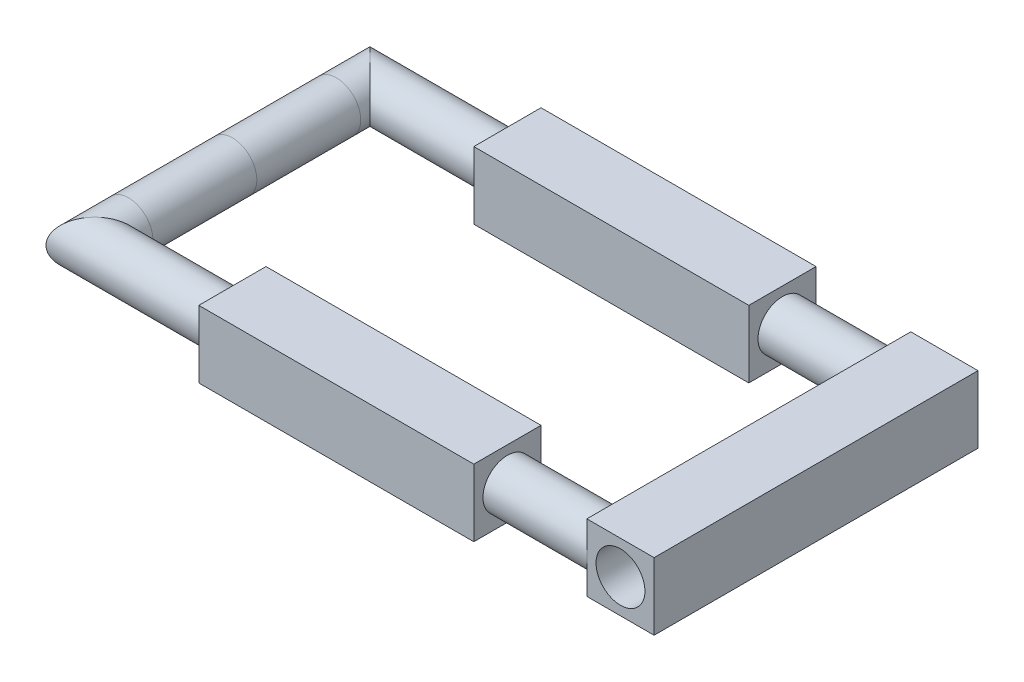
ISO-10303-21;
HEADER;
FILE_DESCRIPTION(('STEP AP214'),'2;1');
FILE_NAME('part.step','',(''),(''),'','','');
FILE_SCHEMA(('AUTOMOTIVE_DESIGN { 1 0 10303 214 1 1 1 1 }'));
ENDSEC;
DATA;
#1=APPLICATION_CONTEXT('core data for automotive mechanical design processes');
#2=APPLICATION_PROTOCOL_DEFINITION('international standard','automotive_design',2000,#1);
#3=PRODUCT_CONTEXT('',#1,'mechanical');
#4=PRODUCT('Part','Part','',(#3));
#5=PRODUCT_RELATED_PRODUCT_CATEGORY('part','',(#4));
#6=PRODUCT_DEFINITION_FORMATION('','',#4);
#7=PRODUCT_DEFINITION_CONTEXT('part definition',#1,'design');
#8=PRODUCT_DEFINITION('design','',#6,#7);
#9=PRODUCT_DEFINITION_SHAPE('','',#8);
#10=(LENGTH_UNIT() NAMED_UNIT(*) SI_UNIT(.MILLI.,.METRE.));
#11=(NAMED_UNIT(*) PLANE_ANGLE_UNIT() SI_UNIT($,.RADIAN.));
#12=(NAMED_UNIT(*) SI_UNIT($,.STERADIAN.) SOLID_ANGLE_UNIT());
#13=UNCERTAINTY_MEASURE_WITH_UNIT(LENGTH_MEASURE(1.E-05),#10,'distance_accuracy_value','');
#14=(GEOMETRIC_REPRESENTATION_CONTEXT(3) GLOBAL_UNCERTAINTY_ASSIGNED_CONTEXT((#13)) GLOBAL_UNIT_ASSIGNED_CONTEXT((#10,
#11,#12)) REPRESENTATION_CONTEXT('',''));
#15=CARTESIAN_POINT('',(0.,0.,0.));
#16=DIRECTION('',(0.,0.,1.));
#17=DIRECTION('',(1.,0.,0.));
#18=AXIS2_PLACEMENT_3D('',#15,#16,#17);
#19=CARTESIAN_POINT('',(-22.452,0.,114.3));
#20=DIRECTION('',(1.,0.,0.));
#21=DIRECTION('',(0.,0.,-1.));
#22=AXIS2_PLACEMENT_3D('',#19,#20,#21);
#23=CYLINDRICAL_SURFACE('',#22,20.32);
#24=CARTESIAN_POINT('',(0.,0.,114.3));
#25=DIRECTION('',(0.707106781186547,0.,0.707106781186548));
#26=DIRECTION('',(-0.707106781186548,0.,0.707106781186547));
#27=AXIS2_PLACEMENT_3D('',#24,#25,#26);
#28=ELLIPSE('',#27,28.7368195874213,20.32);
#29=CARTESIAN_POINT('',(-20.32,0.,134.62));
#30=VERTEX_POINT('',#29);
#31=EDGE_CURVE('E257',#30,#30,#28,.F.);
#32=ORIENTED_EDGE('',*,*,#31,.F.);
#33=EDGE_LOOP('',(#32));
#34=FACE_BOUND('',#33,.T.);
#35=CARTESIAN_POINT('',(114.3,0.,114.3));
#36=DIRECTION('',(1.,0.,0.));
#37=DIRECTION('',(0.,0.,-1.));
#38=AXIS2_PLACEMENT_3D('',#35,#36,#37);
#39=CIRCLE('',#38,20.32);
#40=CARTESIAN_POINT('',(114.3,0.,93.98));
#41=VERTEX_POINT('',#40);
#42=EDGE_CURVE('E249',#41,#41,#39,.T.);
#43=ORIENTED_EDGE('',*,*,#42,.F.);
#44=EDGE_LOOP('',(#43));
#45=FACE_BOUND('',#44,.T.);
#46=ADVANCED_FACE('F36',(#34,#45),#23,.T.);
#47=CARTESIAN_POINT('',(0.,0.,-136.752));
#48=DIRECTION('',(0.,0.,1.));
#49=DIRECTION('',(1.,0.,0.));
#50=AXIS2_PLACEMENT_3D('',#47,#48,#49);
#51=CYLINDRICAL_SURFACE('',#50,20.32);
#52=CARTESIAN_POINT('',(0.,0.,-114.3));
#53=DIRECTION('',(-0.707106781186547,0.,0.707106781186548));
#54=DIRECTION('',(-0.707106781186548,0.,-0.707106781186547));
#55=AXIS2_PLACEMENT_3D('',#52,#53,#54);
#56=ELLIPSE('',#55,28.7368195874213,20.32);
#57=CARTESIAN_POINT('',(-20.3200000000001,0.,-134.62));
#58=VERTEX_POINT('',#57);
#59=EDGE_CURVE('E186',#58,#58,#56,.F.);
#60=ORIENTED_EDGE('',*,*,#59,.F.);
#61=EDGE_LOOP('',(#60));
#62=FACE_BOUND('',#61,.T.);
#63=CARTESIAN_POINT('',(0.,0.,-86.36));
#64=DIRECTION('',(0.,0.,1.));
#65=DIRECTION('',(1.,0.,0.));
#66=AXIS2_PLACEMENT_3D('',#63,#64,#65);
#67=CIRCLE('',#66,20.32);
#68=CARTESIAN_POINT('',(20.32,0.,-86.36));
#69=VERTEX_POINT('',#68);
#70=EDGE_CURVE('E253',#69,#69,#67,.T.);
#71=ORIENTED_EDGE('',*,*,#70,.F.);
#72=EDGE_LOOP('',(#71));
#73=FACE_BOUND('',#72,.T.);
#74=ADVANCED_FACE('F321',(#62,#73),#51,.T.);
#75=CARTESIAN_POINT('',(0.,0.,-86.36));
#76=DIRECTION('',(0.,0.,1.));
#77=DIRECTION('',(1.,0.,0.));
#78=AXIS2_PLACEMENT_3D('',#75,#76,#77);
#79=CYLINDRICAL_SURFACE('',#78,20.32);
#80=CARTESIAN_POINT('',(0.,0.,0.));
#81=DIRECTION('',(0.,0.,1.));
#82=DIRECTION('',(1.,0.,0.));
#83=AXIS2_PLACEMENT_3D('',#80,#81,#82);
#84=CIRCLE('',#83,20.32);
#85=CARTESIAN_POINT('',(20.32,0.,0.));
#86=VERTEX_POINT('',#85);
#87=EDGE_CURVE('E256',#86,#86,#84,.T.);
#88=ORIENTED_EDGE('',*,*,#87,.F.);
#89=EDGE_LOOP('',(#88));
#90=FACE_BOUND('',#89,.T.);
#91=ORIENTED_EDGE('',*,*,#70,.T.);
#92=EDGE_LOOP('',(#91));
#93=FACE_BOUND('',#92,.T.);
#94=ADVANCED_FACE('F324',(#90,#93),#79,.T.);
#95=CARTESIAN_POINT('',(0.,0.,0.));
#96=DIRECTION('',(0.,0.,1.));
#97=DIRECTION('',(1.,0.,0.));
#98=AXIS2_PLACEMENT_3D('',#95,#96,#97);
#99=CYLINDRICAL_SURFACE('',#98,20.32);
#100=CARTESIAN_POINT('',(0.,0.,86.36));
#101=DIRECTION('',(0.,0.,1.));
#102=DIRECTION('',(1.,0.,0.));
#103=AXIS2_PLACEMENT_3D('',#100,#101,#102);
#104=CIRCLE('',#103,20.32);
#105=CARTESIAN_POINT('',(20.32,0.,86.36));
#106=VERTEX_POINT('',#105);
#107=EDGE_CURVE('E252',#106,#106,#104,.T.);
#108=ORIENTED_EDGE('',*,*,#107,.F.);
#109=EDGE_LOOP('',(#108));
#110=FACE_BOUND('',#109,.T.);
#111=ORIENTED_EDGE('',*,*,#87,.T.);
#112=EDGE_LOOP('',(#111));
#113=FACE_BOUND('',#112,.T.);
#114=ADVANCED_FACE('F316',(#110,#113),#99,.T.);
#115=CARTESIAN_POINT('',(0.,0.,86.36));
#116=DIRECTION('',(0.,0.,1.));
#117=DIRECTION('',(1.,0.,0.));
#118=AXIS2_PLACEMENT_3D('',#115,#116,#117);
#119=CYLINDRICAL_SURFACE('',#118,20.32);
#120=ORIENTED_EDGE('',*,*,#107,.T.);
#121=EDGE_LOOP('',(#120));
#122=FACE_BOUND('',#121,.T.);
#123=ORIENTED_EDGE('',*,*,#31,.T.);
#124=EDGE_LOOP('',(#123));
#125=FACE_BOUND('',#124,.T.);
#126=ADVANCED_FACE('F310',(#122,#125),#119,.T.);
#127=CARTESIAN_POINT('',(114.3,0.,-114.3));
#128=DIRECTION('',(-1.,0.,0.));
#129=DIRECTION('',(0.,0.,1.));
#130=AXIS2_PLACEMENT_3D('',#127,#128,#129);
#131=CYLINDRICAL_SURFACE('',#130,20.32);
#132=CARTESIAN_POINT('',(114.3,0.,-114.3));
#133=DIRECTION('',(-1.,0.,0.));
#134=DIRECTION('',(0.,0.,1.));
#135=AXIS2_PLACEMENT_3D('',#132,#133,#134);
#136=CIRCLE('',#135,20.32);
#137=CARTESIAN_POINT('',(114.3,0.,-93.98));
#138=VERTEX_POINT('',#137);
#139=EDGE_CURVE('E246',#138,#138,#136,.T.);
#140=ORIENTED_EDGE('',*,*,#139,.T.);
#141=EDGE_LOOP('',(#140));
#142=FACE_BOUND('',#141,.T.);
#143=ORIENTED_EDGE('',*,*,#59,.T.);
#144=EDGE_LOOP('',(#143));
#145=FACE_BOUND('',#144,.T.);
#146=ADVANCED_FACE('F283',(#142,#145),#131,.T.);
#147=CARTESIAN_POINT('',(342.9,-27.94,-142.24));
#148=DIRECTION('',(-1.,0.,0.));
#149=DIRECTION('',(0.,0.,1.));
#150=AXIS2_PLACEMENT_3D('',#147,#148,#149);
#151=PLANE('',#150);
#152=CARTESIAN_POINT('',(342.9,0.,-114.3));
#153=DIRECTION('',(-1.,0.,0.));
#154=DIRECTION('',(0.,0.,1.));
#155=AXIS2_PLACEMENT_3D('',#152,#153,#154);
#156=CIRCLE('',#155,20.32);
#157=CARTESIAN_POINT('',(342.9,0.,-93.98));
#158=VERTEX_POINT('',#157);
#159=EDGE_CURVE('E183',#158,#158,#156,.F.);
#160=ORIENTED_EDGE('',*,*,#159,.F.);
#161=EDGE_LOOP('',(#160));
#162=FACE_BOUND('',#161,.T.);
#163=DIRECTION('',(0.,1.,0.));
#164=VECTOR('',#163,1.);
#165=CARTESIAN_POINT('',(342.9,-27.94,-142.24));
#166=LINE('',#165,#164);
#167=CARTESIAN_POINT('',(342.9,-27.94,-142.24));
#168=VERTEX_POINT('',#167);
#169=CARTESIAN_POINT('',(342.9,27.94,-142.24));
#170=VERTEX_POINT('',#169);
#171=EDGE_CURVE('E238',#168,#170,#166,.T.);
#172=ORIENTED_EDGE('',*,*,#171,.T.);
#173=DIRECTION('',(0.,0.,1.));
#174=VECTOR('',#173,1.);
#175=CARTESIAN_POINT('',(342.9,27.94,-142.24));
#176=LINE('',#175,#174);
#177=CARTESIAN_POINT('',(342.9,27.94,-86.36));
#178=VERTEX_POINT('',#177);
#179=EDGE_CURVE('E220',#170,#178,#176,.T.);
#180=ORIENTED_EDGE('',*,*,#179,.T.);
#181=DIRECTION('',(0.,1.,0.));
#182=VECTOR('',#181,1.);
#183=CARTESIAN_POINT('',(342.9,-27.94,-86.36));
#184=LINE('',#183,#182);
#185=CARTESIAN_POINT('',(342.9,-27.94,-86.36));
#186=VERTEX_POINT('',#185);
#187=EDGE_CURVE('E244',#186,#178,#184,.T.);
#188=ORIENTED_EDGE('',*,*,#187,.F.);
#189=DIRECTION('',(0.,0.,1.));
#190=VECTOR('',#189,1.);
#191=CARTESIAN_POINT('',(342.9,-27.94,-142.24));
#192=LINE('',#191,#190);
#193=EDGE_CURVE('E232',#168,#186,#192,.T.);
#194=ORIENTED_EDGE('',*,*,#193,.F.);
#195=EDGE_LOOP('',(#172,#180,#188,#194));
#196=FACE_BOUND('',#195,.T.);
#197=ADVANCED_FACE('F279',(#162,#196),#151,.F.);
#198=CARTESIAN_POINT('',(342.9,-27.94,-86.36));
#199=DIRECTION('',(0.,0.,-1.));
#200=DIRECTION('',(-1.,0.,0.));
#201=AXIS2_PLACEMENT_3D('',#198,#199,#200);
#202=PLANE('',#201);
#203=ORIENTED_EDGE('',*,*,#187,.T.);
#204=DIRECTION('',(-1.,0.,0.));
#205=VECTOR('',#204,1.);
#206=CARTESIAN_POINT('',(342.9,27.94,-86.36));
#207=LINE('',#206,#205);
#208=CARTESIAN_POINT('',(114.3,27.94,-86.36));
#209=VERTEX_POINT('',#208);
#210=EDGE_CURVE('E223',#178,#209,#207,.T.);
#211=ORIENTED_EDGE('',*,*,#210,.T.);
#212=DIRECTION('',(0.,1.,0.));
#213=VECTOR('',#212,1.);
#214=CARTESIAN_POINT('',(114.3,-27.94,-86.36));
#215=LINE('',#214,#213);
#216=CARTESIAN_POINT('',(114.3,-27.94,-86.36));
#217=VERTEX_POINT('',#216);
#218=EDGE_CURVE('E242',#217,#209,#215,.T.);
#219=ORIENTED_EDGE('',*,*,#218,.F.);
#220=DIRECTION('',(-1.,0.,0.));
#221=VECTOR('',#220,1.);
#222=CARTESIAN_POINT('',(342.9,-27.94,-86.36));
#223=LINE('',#222,#221);
#224=EDGE_CURVE('E234',#186,#217,#223,.T.);
#225=ORIENTED_EDGE('',*,*,#224,.F.);
#226=EDGE_LOOP('',(#203,#211,#219,#225));
#227=FACE_BOUND('',#226,.T.);
#228=ADVANCED_FACE('F282',(#227),#202,.F.);
#229=CARTESIAN_POINT('',(114.3,-27.94,-114.3));
#230=DIRECTION('',(1.,0.,0.));
#231=DIRECTION('',(0.,0.,-1.));
#232=AXIS2_PLACEMENT_3D('',#229,#230,#231);
#233=PLANE('',#232);
#234=ORIENTED_EDGE('',*,*,#139,.F.);
#235=EDGE_LOOP('',(#234));
#236=FACE_BOUND('',#235,.T.);
#237=ORIENTED_EDGE('',*,*,#218,.T.);
#238=DIRECTION('',(0.,0.,1.));
#239=VECTOR('',#238,1.);
#240=CARTESIAN_POINT('',(114.3,27.94,-114.3));
#241=LINE('',#240,#239);
#242=CARTESIAN_POINT('',(114.3,27.94,-142.24));
#243=VERTEX_POINT('',#242);
#244=EDGE_CURVE('E226',#243,#209,#241,.T.);
#245=ORIENTED_EDGE('',*,*,#244,.F.);
#246=DIRECTION('',(0.,1.,0.));
#247=VECTOR('',#246,1.);
#248=CARTESIAN_POINT('',(114.3,-27.94,-142.24));
#249=LINE('',#248,#247);
#250=CARTESIAN_POINT('',(114.3,-27.94,-142.24));
#251=VERTEX_POINT('',#250);
#252=EDGE_CURVE('E240',#251,#243,#249,.T.);
#253=ORIENTED_EDGE('',*,*,#252,.F.);
#254=DIRECTION('',(0.,0.,1.));
#255=VECTOR('',#254,1.);
#256=CARTESIAN_POINT('',(114.3,-27.94,-114.3));
#257=LINE('',#256,#255);
#258=EDGE_CURVE('E57',#251,#217,#257,.T.);
#259=ORIENTED_EDGE('',*,*,#258,.T.);
#260=EDGE_LOOP('',(#237,#245,#253,#259));
#261=FACE_BOUND('',#260,.T.);
#262=ADVANCED_FACE('F296',(#236,#261),#233,.F.);
#263=CARTESIAN_POINT('',(114.3,-27.94,-142.24));
#264=DIRECTION('',(0.,0.,1.));
#265=DIRECTION('',(1.,0.,0.));
#266=AXIS2_PLACEMENT_3D('',#263,#264,#265);
#267=PLANE('',#266);
#268=ORIENTED_EDGE('',*,*,#252,.T.);
#269=DIRECTION('',(1.,0.,0.));
#270=VECTOR('',#269,1.);
#271=CARTESIAN_POINT('',(114.3,27.94,-142.24));
#272=LINE('',#271,#270);
#273=EDGE_CURVE('E229',#243,#170,#272,.T.);
#274=ORIENTED_EDGE('',*,*,#273,.T.);
#275=ORIENTED_EDGE('',*,*,#171,.F.);
#276=DIRECTION('',(1.,0.,0.));
#277=VECTOR('',#276,1.);
#278=CARTESIAN_POINT('',(114.3,-27.94,-142.24));
#279=LINE('',#278,#277);
#280=EDGE_CURVE('E52',#251,#168,#279,.T.);
#281=ORIENTED_EDGE('',*,*,#280,.F.);
#282=EDGE_LOOP('',(#268,#274,#275,#281));
#283=FACE_BOUND('',#282,.T.);
#284=ADVANCED_FACE('F293',(#283),#267,.F.);
#285=CARTESIAN_POINT('',(0.,-27.94,0.));
#286=DIRECTION('',(0.,-1.,0.));
#287=DIRECTION('',(0.,0.,-1.));
#288=AXIS2_PLACEMENT_3D('',#285,#286,#287);
#289=PLANE('',#288);
#290=ORIENTED_EDGE('',*,*,#193,.T.);
#291=ORIENTED_EDGE('',*,*,#224,.T.);
#292=ORIENTED_EDGE('',*,*,#258,.F.);
#293=ORIENTED_EDGE('',*,*,#280,.T.);
#294=EDGE_LOOP('',(#290,#291,#292,#293));
#295=FACE_BOUND('',#294,.T.);
#296=ADVANCED_FACE('F299',(#295),#289,.T.);
#297=CARTESIAN_POINT('',(0.,27.94,0.));
#298=DIRECTION('',(0.,-1.,0.));
#299=DIRECTION('',(0.,0.,-1.));
#300=AXIS2_PLACEMENT_3D('',#297,#298,#299);
#301=PLANE('',#300);
#302=ORIENTED_EDGE('',*,*,#179,.F.);
#303=ORIENTED_EDGE('',*,*,#273,.F.);
#304=ORIENTED_EDGE('',*,*,#244,.T.);
#305=ORIENTED_EDGE('',*,*,#210,.F.);
#306=EDGE_LOOP('',(#302,#303,#304,#305));
#307=FACE_BOUND('',#306,.T.);
#308=ADVANCED_FACE('F292',(#307),#301,.F.);
#309=CARTESIAN_POINT('',(114.3,-27.94,142.24));
#310=DIRECTION('',(0.,0.,1.));
#311=DIRECTION('',(1.,0.,0.));
#312=AXIS2_PLACEMENT_3D('',#309,#310,#311);
#313=PLANE('',#312);
#314=DIRECTION('',(0.,1.,0.));
#315=VECTOR('',#314,1.);
#316=CARTESIAN_POINT('',(342.9,-27.94,142.24));
#317=LINE('',#316,#315);
#318=CARTESIAN_POINT('',(342.9,-27.94,142.24));
#319=VERTEX_POINT('',#318);
#320=CARTESIAN_POINT('',(342.9,27.94,142.24));
#321=VERTEX_POINT('',#320);
#322=EDGE_CURVE('E190',#319,#321,#317,.T.);
#323=ORIENTED_EDGE('',*,*,#322,.T.);
#324=DIRECTION('',(1.,0.,0.));
#325=VECTOR('',#324,1.);
#326=CARTESIAN_POINT('',(114.3,27.94,142.24));
#327=LINE('',#326,#325);
#328=CARTESIAN_POINT('',(114.3,27.94,142.24));
#329=VERTEX_POINT('',#328);
#330=EDGE_CURVE('E217',#329,#321,#327,.T.);
#331=ORIENTED_EDGE('',*,*,#330,.F.);
#332=DIRECTION('',(0.,1.,0.));
#333=VECTOR('',#332,1.);
#334=CARTESIAN_POINT('',(114.3,-27.94,142.24));
#335=LINE('',#334,#333);
#336=CARTESIAN_POINT('',(114.3,-27.94,142.24));
#337=VERTEX_POINT('',#336);
#338=EDGE_CURVE('E189',#337,#329,#335,.T.);
#339=ORIENTED_EDGE('',*,*,#338,.F.);
#340=DIRECTION('',(1.,0.,0.));
#341=VECTOR('',#340,1.);
#342=CARTESIAN_POINT('',(114.3,-27.94,142.24));
#343=LINE('',#342,#341);
#344=EDGE_CURVE('E205',#337,#319,#343,.T.);
#345=ORIENTED_EDGE('',*,*,#344,.T.);
#346=EDGE_LOOP('',(#323,#331,#339,#345));
#347=FACE_BOUND('',#346,.T.);
#348=ADVANCED_FACE('F306',(#347),#313,.T.);
#349=CARTESIAN_POINT('',(114.3,-27.94,114.3));
#350=DIRECTION('',(-1.,0.,0.));
#351=DIRECTION('',(0.,0.,1.));
#352=AXIS2_PLACEMENT_3D('',#349,#350,#351);
#353=PLANE('',#352);
#354=ORIENTED_EDGE('',*,*,#42,.T.);
#355=EDGE_LOOP('',(#354));
#356=FACE_BOUND('',#355,.T.);
#357=ORIENTED_EDGE('',*,*,#338,.T.);
#358=DIRECTION('',(0.,0.,-1.));
#359=VECTOR('',#358,1.);
#360=CARTESIAN_POINT('',(114.3,27.94,114.3));
#361=LINE('',#360,#359);
#362=CARTESIAN_POINT('',(114.3,27.94,86.36));
#363=VERTEX_POINT('',#362);
#364=EDGE_CURVE('E208',#329,#363,#361,.T.);
#365=ORIENTED_EDGE('',*,*,#364,.T.);
#366=DIRECTION('',(0.,1.,0.));
#367=VECTOR('',#366,1.);
#368=CARTESIAN_POINT('',(114.3,-27.94,86.36));
#369=LINE('',#368,#367);
#370=CARTESIAN_POINT('',(114.3,-27.94,86.36));
#371=VERTEX_POINT('',#370);
#372=EDGE_CURVE('E195',#371,#363,#369,.T.);
#373=ORIENTED_EDGE('',*,*,#372,.F.);
#374=DIRECTION('',(0.,0.,-1.));
#375=VECTOR('',#374,1.);
#376=CARTESIAN_POINT('',(114.3,-27.94,114.3));
#377=LINE('',#376,#375);
#378=EDGE_CURVE('E192',#337,#371,#377,.T.);
#379=ORIENTED_EDGE('',*,*,#378,.F.);
#380=EDGE_LOOP('',(#357,#365,#373,#379));
#381=FACE_BOUND('',#380,.T.);
#382=ADVANCED_FACE('F346',(#356,#381),#353,.T.);
#383=CARTESIAN_POINT('',(342.9,-27.94,86.36));
#384=DIRECTION('',(0.,0.,-1.));
#385=DIRECTION('',(-1.,0.,0.));
#386=AXIS2_PLACEMENT_3D('',#383,#384,#385);
#387=PLANE('',#386);
#388=ORIENTED_EDGE('',*,*,#372,.T.);
#389=DIRECTION('',(-1.,0.,0.));
#390=VECTOR('',#389,1.);
#391=CARTESIAN_POINT('',(342.9,27.94,86.36));
#392=LINE('',#391,#390);
#393=CARTESIAN_POINT('',(342.9,27.94,86.36));
#394=VERTEX_POINT('',#393);
#395=EDGE_CURVE('E211',#394,#363,#392,.T.);
#396=ORIENTED_EDGE('',*,*,#395,.F.);
#397=DIRECTION('',(0.,1.,0.));
#398=VECTOR('',#397,1.);
#399=CARTESIAN_POINT('',(342.9,-27.94,86.36));
#400=LINE('',#399,#398);
#401=CARTESIAN_POINT('',(342.9,-27.94,86.36));
#402=VERTEX_POINT('',#401);
#403=EDGE_CURVE('E193',#402,#394,#400,.T.);
#404=ORIENTED_EDGE('',*,*,#403,.F.);
#405=DIRECTION('',(-1.,0.,0.));
#406=VECTOR('',#405,1.);
#407=CARTESIAN_POINT('',(342.9,-27.94,86.36));
#408=LINE('',#407,#406);
#409=EDGE_CURVE('E199',#402,#371,#408,.T.);
#410=ORIENTED_EDGE('',*,*,#409,.T.);
#411=EDGE_LOOP('',(#388,#396,#404,#410));
#412=FACE_BOUND('',#411,.T.);
#413=ADVANCED_FACE('F349',(#412),#387,.T.);
#414=CARTESIAN_POINT('',(342.9,-27.94,142.24));
#415=DIRECTION('',(1.,0.,0.));
#416=DIRECTION('',(0.,0.,-1.));
#417=AXIS2_PLACEMENT_3D('',#414,#415,#416);
#418=PLANE('',#417);
#419=CARTESIAN_POINT('',(342.9,0.,114.3));
#420=DIRECTION('',(1.,0.,0.));
#421=DIRECTION('',(0.,0.,-1.));
#422=AXIS2_PLACEMENT_3D('',#419,#420,#421);
#423=CIRCLE('',#422,20.32);
#424=CARTESIAN_POINT('',(342.9,0.,93.98));
#425=VERTEX_POINT('',#424);
#426=EDGE_CURVE('E143',#425,#425,#423,.F.);
#427=ORIENTED_EDGE('',*,*,#426,.T.);
#428=EDGE_LOOP('',(#427));
#429=FACE_BOUND('',#428,.T.);
#430=ORIENTED_EDGE('',*,*,#403,.T.);
#431=DIRECTION('',(0.,0.,-1.));
#432=VECTOR('',#431,1.);
#433=CARTESIAN_POINT('',(342.9,27.94,142.24));
#434=LINE('',#433,#432);
#435=EDGE_CURVE('E214',#321,#394,#434,.T.);
#436=ORIENTED_EDGE('',*,*,#435,.F.);
#437=ORIENTED_EDGE('',*,*,#322,.F.);
#438=DIRECTION('',(0.,0.,-1.));
#439=VECTOR('',#438,1.);
#440=CARTESIAN_POINT('',(342.9,-27.94,142.24));
#441=LINE('',#440,#439);
#442=EDGE_CURVE('E202',#319,#402,#441,.T.);
#443=ORIENTED_EDGE('',*,*,#442,.T.);
#444=EDGE_LOOP('',(#430,#436,#437,#443));
#445=FACE_BOUND('',#444,.T.);
#446=ADVANCED_FACE('F362',(#429,#445),#418,.T.);
#447=CARTESIAN_POINT('',(0.,-27.94,0.));
#448=DIRECTION('',(0.,1.,0.));
#449=DIRECTION('',(0.,0.,1.));
#450=AXIS2_PLACEMENT_3D('',#447,#448,#449);
#451=PLANE('',#450);
#452=ORIENTED_EDGE('',*,*,#344,.F.);
#453=ORIENTED_EDGE('',*,*,#378,.T.);
#454=ORIENTED_EDGE('',*,*,#409,.F.);
#455=ORIENTED_EDGE('',*,*,#442,.F.);
#456=EDGE_LOOP('',(#452,#453,#454,#455));
#457=FACE_BOUND('',#456,.T.);
#458=ADVANCED_FACE('F366',(#457),#451,.F.);
#459=CARTESIAN_POINT('',(0.,27.94,0.));
#460=DIRECTION('',(0.,1.,0.));
#461=DIRECTION('',(0.,0.,1.));
#462=AXIS2_PLACEMENT_3D('',#459,#460,#461);
#463=PLANE('',#462);
#464=ORIENTED_EDGE('',*,*,#330,.T.);
#465=ORIENTED_EDGE('',*,*,#435,.T.);
#466=ORIENTED_EDGE('',*,*,#395,.T.);
#467=ORIENTED_EDGE('',*,*,#364,.F.);
#468=EDGE_LOOP('',(#464,#465,#466,#467));
#469=FACE_BOUND('',#468,.T.);
#470=ADVANCED_FACE('F276',(#469),#463,.T.);
#471=CARTESIAN_POINT('',(479.652,0.,114.3));
#472=DIRECTION('',(-1.,0.,0.));
#473=DIRECTION('',(0.,0.,1.));
#474=AXIS2_PLACEMENT_3D('',#471,#472,#473);
#475=CYLINDRICAL_SURFACE('',#474,20.32);
#476=CARTESIAN_POINT('',(429.26,0.,114.3));
#477=DIRECTION('',(-1.,0.,0.));
#478=DIRECTION('',(0.,0.,1.));
#479=AXIS2_PLACEMENT_3D('',#476,#477,#478);
#480=CIRCLE('',#479,20.32);
#481=CARTESIAN_POINT('',(429.26,0.,134.62));
#482=VERTEX_POINT('',#481);
#483=EDGE_CURVE('E11',#482,#482,#480,.F.);
#484=ORIENTED_EDGE('',*,*,#483,.F.);
#485=EDGE_LOOP('',(#484));
#486=FACE_BOUND('',#485,.T.);
#487=ORIENTED_EDGE('',*,*,#426,.F.);
#488=EDGE_LOOP('',(#487));
#489=FACE_BOUND('',#488,.T.);
#490=ADVANCED_FACE('F274',(#486,#489),#475,.T.);
#491=CARTESIAN_POINT('',(342.9,0.,-114.3));
#492=DIRECTION('',(1.,0.,0.));
#493=DIRECTION('',(0.,0.,-1.));
#494=AXIS2_PLACEMENT_3D('',#491,#492,#493);
#495=CYLINDRICAL_SURFACE('',#494,20.32);
#496=CARTESIAN_POINT('',(429.26,0.,-114.3));
#497=DIRECTION('',(-1.,0.,0.));
#498=DIRECTION('',(0.,0.,1.));
#499=AXIS2_PLACEMENT_3D('',#496,#497,#498);
#500=CIRCLE('',#499,20.32);
#501=CARTESIAN_POINT('',(429.26,0.,-134.62));
#502=VERTEX_POINT('',#501);
#503=EDGE_CURVE('E44',#502,#502,#500,.F.);
#504=ORIENTED_EDGE('',*,*,#503,.F.);
#505=EDGE_LOOP('',(#504));
#506=FACE_BOUND('',#505,.T.);
#507=ORIENTED_EDGE('',*,*,#159,.T.);
#508=EDGE_LOOP('',(#507));
#509=FACE_BOUND('',#508,.T.);
#510=ADVANCED_FACE('F271',(#506,#509),#495,.T.);
#511=CARTESIAN_POINT('',(485.14,-27.94,-134.62));
#512=DIRECTION('',(-1.,0.,0.));
#513=DIRECTION('',(0.,0.,1.));
#514=AXIS2_PLACEMENT_3D('',#511,#512,#513);
#515=PLANE('',#514);
#516=DIRECTION('',(0.,1.,0.));
#517=VECTOR('',#516,1.);
#518=CARTESIAN_POINT('',(485.14,-27.94,-134.62));
#519=LINE('',#518,#517);
#520=CARTESIAN_POINT('',(485.14,-27.94,-134.62));
#521=VERTEX_POINT('',#520);
#522=CARTESIAN_POINT('',(485.14,27.94,-134.62));
#523=VERTEX_POINT('',#522);
#524=EDGE_CURVE('E158',#521,#523,#519,.T.);
#525=ORIENTED_EDGE('',*,*,#524,.T.);
#526=DIRECTION('',(0.,0.,1.));
#527=VECTOR('',#526,1.);
#528=CARTESIAN_POINT('',(485.14,27.94,-134.62));
#529=LINE('',#528,#527);
#530=CARTESIAN_POINT('',(485.14,27.94,134.62));
#531=VERTEX_POINT('',#530);
#532=EDGE_CURVE('E151',#523,#531,#529,.T.);
#533=ORIENTED_EDGE('',*,*,#532,.T.);
#534=DIRECTION('',(0.,1.,0.));
#535=VECTOR('',#534,1.);
#536=CARTESIAN_POINT('',(485.14,-27.94,134.62));
#537=LINE('',#536,#535);
#538=CARTESIAN_POINT('',(485.14,-27.94,134.62));
#539=VERTEX_POINT('',#538);
#540=EDGE_CURVE('E132',#539,#531,#537,.T.);
#541=ORIENTED_EDGE('',*,*,#540,.F.);
#542=DIRECTION('',(0.,0.,1.));
#543=VECTOR('',#542,1.);
#544=CARTESIAN_POINT('',(485.14,-27.94,-134.62));
#545=LINE('',#544,#543);
#546=EDGE_CURVE('E167',#521,#539,#545,.T.);
#547=ORIENTED_EDGE('',*,*,#546,.F.);
#548=EDGE_LOOP('',(#525,#533,#541,#547));
#549=FACE_BOUND('',#548,.T.);
#550=ADVANCED_FACE('F156',(#549),#515,.F.);
#551=CARTESIAN_POINT('',(485.14,-27.94,134.62));
#552=DIRECTION('',(0.,0.,-1.));
#553=DIRECTION('',(-1.,0.,0.));
#554=AXIS2_PLACEMENT_3D('',#551,#552,#553);
#555=PLANE('',#554);
#556=CARTESIAN_POINT('',(457.2,0.,134.62));
#557=DIRECTION('',(0.,0.,1.));
#558=DIRECTION('',(1.,0.,0.));
#559=AXIS2_PLACEMENT_3D('',#556,#557,#558);
#560=CIRCLE('',#559,20.3199999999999);
#561=CARTESIAN_POINT('',(477.52,0.,134.62));
#562=VERTEX_POINT('',#561);
#563=EDGE_CURVE('E161',#562,#562,#560,.T.);
#564=ORIENTED_EDGE('',*,*,#563,.F.);
#565=EDGE_LOOP('',(#564));
#566=FACE_BOUND('',#565,.T.);
#567=ORIENTED_EDGE('',*,*,#540,.T.);
#568=DIRECTION('',(-1.,0.,0.));
#569=VECTOR('',#568,1.);
#570=CARTESIAN_POINT('',(485.14,27.94,134.62));
#571=LINE('',#570,#569);
#572=CARTESIAN_POINT('',(429.26,27.94,134.62));
#573=VERTEX_POINT('',#572);
#574=EDGE_CURVE('E136',#531,#573,#571,.T.);
#575=ORIENTED_EDGE('',*,*,#574,.T.);
#576=DIRECTION('',(0.,1.,0.));
#577=VECTOR('',#576,1.);
#578=CARTESIAN_POINT('',(429.26,-27.94,134.62));
#579=LINE('',#578,#577);
#580=EDGE_CURVE('E180',#482,#573,#579,.T.);
#581=ORIENTED_EDGE('',*,*,#580,.F.);
#582=CARTESIAN_POINT('',(429.26,-27.94,134.62));
#583=VERTEX_POINT('',#582);
#584=EDGE_CURVE('E144',#583,#482,#579,.T.);
#585=ORIENTED_EDGE('',*,*,#584,.F.);
#586=DIRECTION('',(-1.,0.,0.));
#587=VECTOR('',#586,1.);
#588=CARTESIAN_POINT('',(485.14,-27.94,134.62));
#589=LINE('',#588,#587);
#590=EDGE_CURVE('E138',#539,#583,#589,.T.);
#591=ORIENTED_EDGE('',*,*,#590,.F.);
#592=EDGE_LOOP('',(#567,#575,#581,#585,#591));
#593=FACE_BOUND('',#592,.T.);
#594=ADVANCED_FACE('F134',(#566,#593),#555,.F.);
#595=CARTESIAN_POINT('',(429.26,-27.94,-134.62));
#596=DIRECTION('',(-1.,0.,0.));
#597=DIRECTION('',(0.,0.,1.));
#598=AXIS2_PLACEMENT_3D('',#595,#596,#597);
#599=PLANE('',#598);
#600=ORIENTED_EDGE('',*,*,#584,.T.);
#601=ORIENTED_EDGE('',*,*,#483,.T.);
#602=ORIENTED_EDGE('',*,*,#580,.T.);
#603=DIRECTION('',(0.,0.,1.));
#604=VECTOR('',#603,1.);
#605=CARTESIAN_POINT('',(429.26,27.94,-134.62));
#606=LINE('',#605,#604);
#607=CARTESIAN_POINT('',(429.26,27.94,-134.62));
#608=VERTEX_POINT('',#607);
#609=EDGE_CURVE('E154',#608,#573,#606,.T.);
#610=ORIENTED_EDGE('',*,*,#609,.F.);
#611=DIRECTION('',(0.,1.,0.));
#612=VECTOR('',#611,1.);
#613=CARTESIAN_POINT('',(429.26,-27.94,-134.62));
#614=LINE('',#613,#612);
#615=EDGE_CURVE('E176',#502,#608,#614,.T.);
#616=ORIENTED_EDGE('',*,*,#615,.F.);
#617=ORIENTED_EDGE('',*,*,#503,.T.);
#618=CARTESIAN_POINT('',(429.26,-27.94,-134.62));
#619=VERTEX_POINT('',#618);
#620=EDGE_CURVE('E177',#619,#502,#614,.T.);
#621=ORIENTED_EDGE('',*,*,#620,.F.);
#622=DIRECTION('',(0.,0.,1.));
#623=VECTOR('',#622,1.);
#624=CARTESIAN_POINT('',(429.26,-27.94,-134.62));
#625=LINE('',#624,#623);
#626=EDGE_CURVE('E170',#619,#583,#625,.T.);
#627=ORIENTED_EDGE('',*,*,#626,.T.);
#628=EDGE_LOOP('',(#600,#601,#602,#610,#616,#617,#621,#627));
#629=FACE_BOUND('',#628,.T.);
#630=ADVANCED_FACE('F268',(#629),#599,.T.);
#631=CARTESIAN_POINT('',(429.26,-27.94,-134.62));
#632=DIRECTION('',(0.,0.,1.));
#633=DIRECTION('',(1.,0.,0.));
#634=AXIS2_PLACEMENT_3D('',#631,#632,#633);
#635=PLANE('',#634);
#636=CARTESIAN_POINT('',(457.2,0.,-134.62));
#637=DIRECTION('',(0.,0.,1.));
#638=DIRECTION('',(1.,0.,0.));
#639=AXIS2_PLACEMENT_3D('',#636,#637,#638);
#640=CIRCLE('',#639,20.3199999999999);
#641=CARTESIAN_POINT('',(477.52,0.,-134.62));
#642=VERTEX_POINT('',#641);
#643=EDGE_CURVE('E39',#642,#642,#640,.T.);
#644=ORIENTED_EDGE('',*,*,#643,.T.);
#645=EDGE_LOOP('',(#644));
#646=FACE_BOUND('',#645,.T.);
#647=ORIENTED_EDGE('',*,*,#620,.T.);
#648=ORIENTED_EDGE('',*,*,#615,.T.);
#649=DIRECTION('',(1.,0.,0.));
#650=VECTOR('',#649,1.);
#651=CARTESIAN_POINT('',(429.26,27.94,-134.62));
#652=LINE('',#651,#650);
#653=EDGE_CURVE('E165',#608,#523,#652,.T.);
#654=ORIENTED_EDGE('',*,*,#653,.T.);
#655=ORIENTED_EDGE('',*,*,#524,.F.);
#656=DIRECTION('',(1.,0.,0.));
#657=VECTOR('',#656,1.);
#658=CARTESIAN_POINT('',(429.26,-27.94,-134.62));
#659=LINE('',#658,#657);
#660=EDGE_CURVE('E173',#619,#521,#659,.T.);
#661=ORIENTED_EDGE('',*,*,#660,.F.);
#662=EDGE_LOOP('',(#647,#648,#654,#655,#661));
#663=FACE_BOUND('',#662,.T.);
#664=ADVANCED_FACE('F391',(#646,#663),#635,.F.);
#665=CARTESIAN_POINT('',(0.,-27.94,0.));
#666=DIRECTION('',(0.,-1.,0.));
#667=DIRECTION('',(0.,0.,-1.));
#668=AXIS2_PLACEMENT_3D('',#665,#666,#667);
#669=PLANE('',#668);
#670=ORIENTED_EDGE('',*,*,#546,.T.);
#671=ORIENTED_EDGE('',*,*,#590,.T.);
#672=ORIENTED_EDGE('',*,*,#626,.F.);
#673=ORIENTED_EDGE('',*,*,#660,.T.);
#674=EDGE_LOOP('',(#670,#671,#672,#673));
#675=FACE_BOUND('',#674,.T.);
#676=ADVANCED_FACE('F394',(#675),#669,.T.);
#677=CARTESIAN_POINT('',(0.,27.94,0.));
#678=DIRECTION('',(0.,-1.,0.));
#679=DIRECTION('',(0.,0.,-1.));
#680=AXIS2_PLACEMENT_3D('',#677,#678,#679);
#681=PLANE('',#680);
#682=ORIENTED_EDGE('',*,*,#532,.F.);
#683=ORIENTED_EDGE('',*,*,#653,.F.);
#684=ORIENTED_EDGE('',*,*,#609,.T.);
#685=ORIENTED_EDGE('',*,*,#574,.F.);
#686=EDGE_LOOP('',(#682,#683,#684,#685));
#687=FACE_BOUND('',#686,.T.);
#688=ADVANCED_FACE('F149',(#687),#681,.F.);
#689=CARTESIAN_POINT('',(457.2,0.,-142.24));
#690=DIRECTION('',(0.,0.,1.));
#691=DIRECTION('',(1.,0.,0.));
#692=AXIS2_PLACEMENT_3D('',#689,#690,#691);
#693=CYLINDRICAL_SURFACE('',#692,20.3199999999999);
#694=ORIENTED_EDGE('',*,*,#563,.T.);
#695=EDGE_LOOP('',(#694));
#696=FACE_BOUND('',#695,.T.);
#697=ORIENTED_EDGE('',*,*,#643,.F.);
#698=EDGE_LOOP('',(#697));
#699=FACE_BOUND('',#698,.T.);
#700=ADVANCED_FACE('F401',(#696,#699),#693,.F.);
#701=CLOSED_SHELL('',(#46,#74,#94,#114,#126,#146,#197,#228,#262,#284,#296,#308,#348,#382,#413,
#446,#458,#470,#490,#510,#550,#594,#630,#664,#676,#688,#700));
#702=MANIFOLD_SOLID_BREP('B2',#701);
#703=ADVANCED_BREP_SHAPE_REPRESENTATION('',(#18,#702),#14);
#704=SHAPE_DEFINITION_REPRESENTATION(#9,#703);
ENDSEC;
END-ISO-10303-21;
